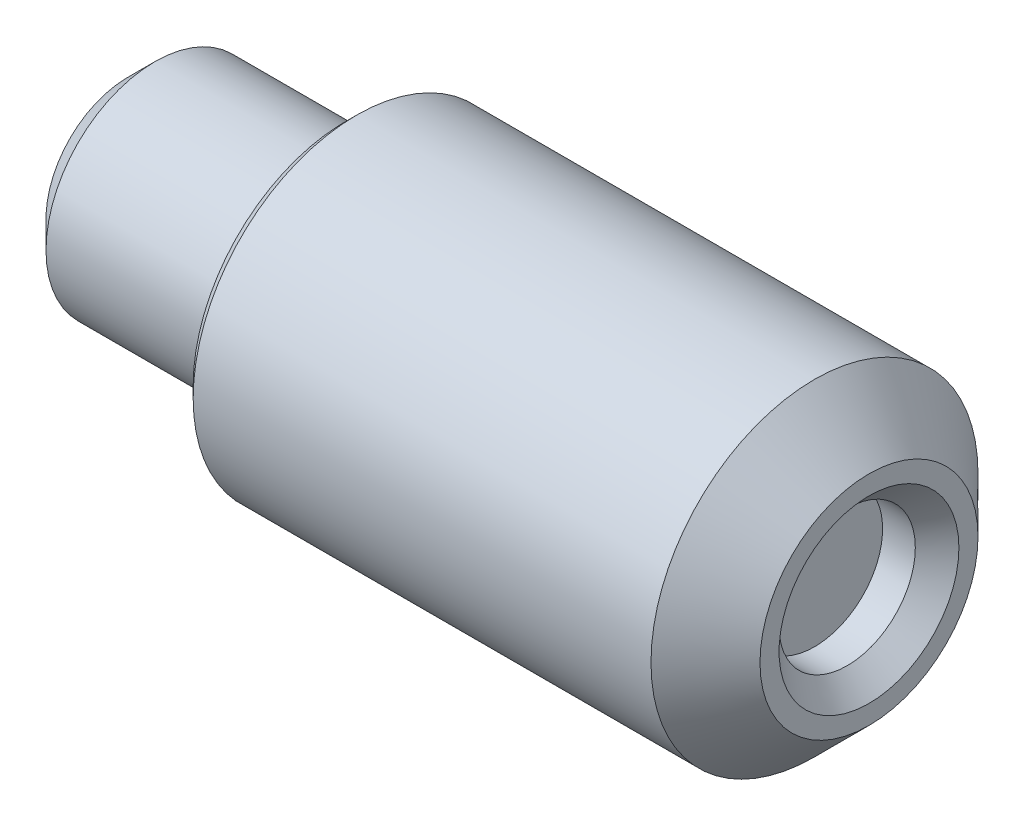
from build123d import *

# Parameters (mm, degrees)
CHANFREIN2_SIZE = 1
CHANFREIN3_SIZE = 0.4
CHANFREIN4_SIZE = 0.2
CHANFREIN5_SIZE = 0.5


with BuildPart() as part:
    # Esquisse1 → R_volution1 (revolve)
    with BuildSketch(Plane.XY, mode=Mode.PRIVATE) as r_volution1_sk:
        Polygon((-1, 0), (-1, 1.25), (0, 1.25), (0, 3), (-9.6, 3), (-9.6, 2), (-13.6, 2), (-13.6, 0), align=None)
    revolve(r_volution1_sk.sketch.rotate(Axis((0, 0, 0), (1, 0, 0)), 90), axis=Axis((0, 0, 0), (1, 0, 0)))

    # Chanfrein2
    chanfrein2_edges = [part.edges().sort_by_distance(p)[0] for p in [
        (0, 0, -3),
    ]]
    chamfer(chanfrein2_edges, length=CHANFREIN2_SIZE)

    # Chanfrein3
    chanfrein3_edges = [part.edges().sort_by_distance(p)[0] for p in [
        (0, 0, -1.25),
    ]]
    chamfer(chanfrein3_edges, length=CHANFREIN3_SIZE)

    # Chanfrein4
    chanfrein4_edges = [part.edges().sort_by_distance(p)[0] for p in [
        (-9.6, 0, -3),
    ]]
    chamfer(chanfrein4_edges, length=CHANFREIN4_SIZE)

    # Chanfrein5
    chanfrein5_edges = [part.edges().sort_by_distance(p)[0] for p in [
        (-13.6, 0, -2),
    ]]
    chamfer(chanfrein5_edges, length=CHANFREIN5_SIZE)


solid = part.part
